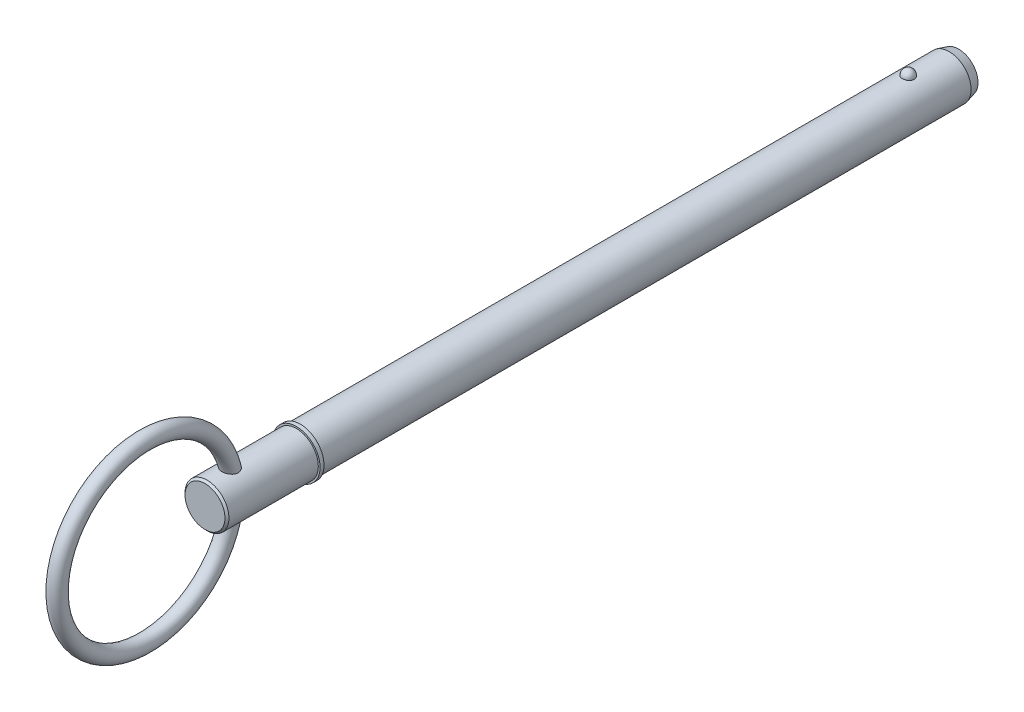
from build123d import *

# Parameters (mm, degrees)
SKETCH2_R           = 5.555
BOSS_EXTRUDE1_DEPTH = 152.4
BOSS_EXTRUDE2_START = 14.27
SKETCH3_R           = 5.555
BOSS_EXTRUDE2_DEPTH = 14.27
CHAMFER1_SIZE       = 2.4
CHAMFER1_SIZE2      = 0.643078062
SKETCH20_W          = 1
SKETCH20_H          = 6
SKETCH21_R          = 5.555
BOSS_EXTRUDE3_DEPTH = 24.13
CHAMFER2_SIZE       = 0.5
SKETCH24_R          = 2


with BuildPart() as part:
    # Sketch2 → Boss-Extrude1 (new body)
    with BuildSketch(Plane.XY):
        with Locations(Location((0, 0, 0), (0, 0, 180))):
            Circle(SKETCH2_R)
    extrude(amount=BOSS_EXTRUDE1_DEPTH)

    # Sketch3 → Boss-Extrude2 (add)
    with BuildSketch(Plane(origin=(0, 0, 0), x_dir=(-1, 0, 0), z_dir=(0, 0, -1)).offset(BOSS_EXTRUDE2_START)):
        Circle(SKETCH3_R)
    extrude(amount=-BOSS_EXTRUDE2_DEPTH)

    # Chamfer1
    chamfer1_edges = [part.edges().sort_by_distance(p)[0] for p in [
        (5.555, 0, -14.27),
    ]]
    chamfer1_side = [part.faces().sort_by_distance(p)[0] for p in [
        (5.555, 0, 69.065),
    ]]
    chamfer(chamfer1_edges, length=CHAMFER1_SIZE, length2=CHAMFER1_SIZE2, reference=chamfer1_side[0])

    # Sketch18 → Revolve1 (revolve)
    with BuildSketch(Plane(origin=(0, 0, 0), x_dir=(0, 0, -1), z_dir=(1, 0, 0))):
        with BuildLine():
            Line((1.49, 7.045), (1.49, 4.065))
            ThreePointArc((1.49, 4.065), (0, 5.555), (1.49, 7.045))
        make_face()
    revolve(axis=Axis((0, 7.045, -1.49), (0, -1, 0)))

    # Sketch20 → Revolve2 (revolve)
    with BuildSketch(Plane(origin=(0, 0, 0), x_dir=(0, 0, -1), z_dir=(1, 0, 0)), mode=Mode.PRIVATE) as revolve2_sk:
        with Locations((-152.9, 3)):
            Rectangle(SKETCH20_W, SKETCH20_H)
    revolve(revolve2_sk.sketch.rotate(Axis((0, 0, 33.728787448), (0, 0, 1)), 90), axis=Axis((0, 0, 33.728787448), (0, 0, 1)))

    # Sketch21 → Boss-Extrude3 (add)
    with BuildSketch(Plane(origin=(0, 0, 152.4), x_dir=(-1, 0, 0), z_dir=(0, 0, -1))):
        Circle(SKETCH21_R)
    extrude(amount=-BOSS_EXTRUDE3_DEPTH)

    # Chamfer2
    chamfer2_edges = [part.edges().sort_by_distance(p)[0] for p in [
        (5.555, 0, 176.53),
    ]]
    chamfer(chamfer2_edges, length=CHAMFER2_SIZE)

    # Sweep1: sweep along a path in Sketch23
    with BuildLine(Plane(origin=(0, 0, 0), x_dir=(0, 0, -1), z_dir=(1, 0, 0))) as sweep1_path:
        CenterArc((-191.755, 0), 22.225, 0, 360)
    # Sketch24 → Sweep1 (sweep)
    with BuildSketch(Plane(origin=(0, 0, 0), x_dir=(1, 0, 0), z_dir=(0, 1, 0))):
        with Locations((0, -169.53)):
            Circle(SKETCH24_R)
    sweep(path=sweep1_path.line)


solid = part.part
